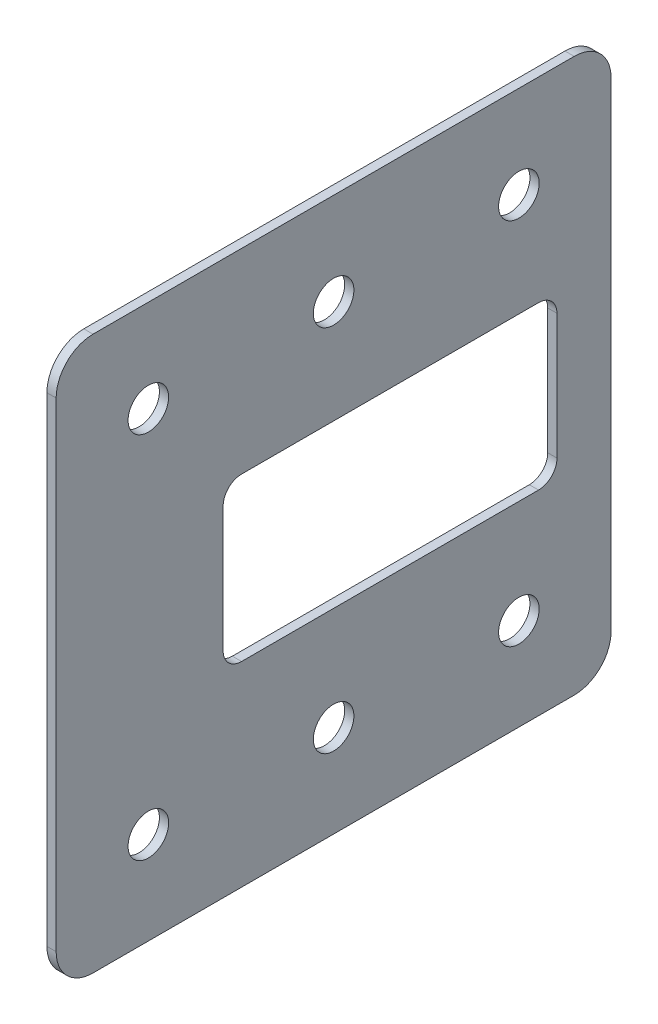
ISO-10303-21;
HEADER;
FILE_DESCRIPTION(('STEP AP214'),'2;1');
FILE_NAME('part.step','',(''),(''),'','','');
FILE_SCHEMA(('AUTOMOTIVE_DESIGN { 1 0 10303 214 1 1 1 1 }'));
ENDSEC;
DATA;
#1=APPLICATION_CONTEXT('core data for automotive mechanical design processes');
#2=APPLICATION_PROTOCOL_DEFINITION('international standard','automotive_design',2000,#1);
#3=PRODUCT_CONTEXT('',#1,'mechanical');
#4=PRODUCT('Part','Part','',(#3));
#5=PRODUCT_RELATED_PRODUCT_CATEGORY('part','',(#4));
#6=PRODUCT_DEFINITION_FORMATION('','',#4);
#7=PRODUCT_DEFINITION_CONTEXT('part definition',#1,'design');
#8=PRODUCT_DEFINITION('design','',#6,#7);
#9=PRODUCT_DEFINITION_SHAPE('','',#8);
#10=(LENGTH_UNIT() NAMED_UNIT(*) SI_UNIT(.MILLI.,.METRE.));
#11=(NAMED_UNIT(*) PLANE_ANGLE_UNIT() SI_UNIT($,.RADIAN.));
#12=(NAMED_UNIT(*) SI_UNIT($,.STERADIAN.) SOLID_ANGLE_UNIT());
#13=UNCERTAINTY_MEASURE_WITH_UNIT(LENGTH_MEASURE(1.E-05),#10,'distance_accuracy_value','');
#14=(GEOMETRIC_REPRESENTATION_CONTEXT(3) GLOBAL_UNCERTAINTY_ASSIGNED_CONTEXT((#13)) GLOBAL_UNIT_ASSIGNED_CONTEXT((#10,
#11,#12)) REPRESENTATION_CONTEXT('',''));
#15=CARTESIAN_POINT('',(0.,0.,0.));
#16=DIRECTION('',(0.,0.,1.));
#17=DIRECTION('',(1.,0.,0.));
#18=AXIS2_PLACEMENT_3D('',#15,#16,#17);
#19=CARTESIAN_POINT('',(8.89420183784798,150.,-191.416951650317));
#20=DIRECTION('',(0.,-1.,0.));
#21=DIRECTION('',(0.,0.,-1.));
#22=AXIS2_PLACEMENT_3D('',#19,#20,#21);
#23=PLANE('',#22);
#24=DIRECTION('',(0.,0.,-1.));
#25=VECTOR('',#24,1.);
#26=CARTESIAN_POINT('',(8.89420183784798,150.,-191.416951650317));
#27=LINE('',#26,#25);
#28=CARTESIAN_POINT('',(8.89420183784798,150.,-211.416951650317));
#29=VERTEX_POINT('',#28);
#30=CARTESIAN_POINT('',(8.89420183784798,150.,-472.33578257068));
#31=VERTEX_POINT('',#30);
#32=EDGE_CURVE('E170',#29,#31,#27,.T.);
#33=ORIENTED_EDGE('',*,*,#32,.F.);
#34=DIRECTION('',(-1.,0.,0.));
#35=VECTOR('',#34,1.);
#36=CARTESIAN_POINT('',(13.894201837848,150.,-211.416951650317));
#37=LINE('',#36,#35);
#38=CARTESIAN_POINT('',(13.894201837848,150.,-211.416951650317));
#39=VERTEX_POINT('',#38);
#40=EDGE_CURVE('E152',#29,#39,#37,.F.);
#41=ORIENTED_EDGE('',*,*,#40,.T.);
#42=DIRECTION('',(0.,0.,-1.));
#43=VECTOR('',#42,1.);
#44=CARTESIAN_POINT('',(13.894201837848,150.,-191.416951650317));
#45=LINE('',#44,#43);
#46=CARTESIAN_POINT('',(13.894201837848,150.,-472.33578257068));
#47=VERTEX_POINT('',#46);
#48=EDGE_CURVE('E177',#39,#47,#45,.T.);
#49=ORIENTED_EDGE('',*,*,#48,.T.);
#50=DIRECTION('',(-1.,0.,0.));
#51=VECTOR('',#50,1.);
#52=CARTESIAN_POINT('',(8.894201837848,150.,-472.33578257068));
#53=LINE('',#52,#51);
#54=EDGE_CURVE('E215',#47,#31,#53,.T.);
#55=ORIENTED_EDGE('',*,*,#54,.T.);
#56=EDGE_LOOP('',(#33,#41,#49,#55));
#57=FACE_BOUND('',#56,.T.);
#58=ADVANCED_FACE('F34',(#57),#23,.F.);
#59=CARTESIAN_POINT('',(8.89420183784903,-150.,-191.416951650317));
#60=DIRECTION('',(1.,0.,0.));
#61=DIRECTION('',(0.,1.,0.));
#62=AXIS2_PLACEMENT_3D('',#59,#60,#61);
#63=PLANE('',#62);
#64=DIRECTION('',(0.,0.,1.));
#65=VECTOR('',#64,1.);
#66=CARTESIAN_POINT('',(8.89420183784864,-43.9999999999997,-462.992636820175));
#67=LINE('',#66,#65);
#68=CARTESIAN_POINT('',(8.89420183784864,-43.9999999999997,-452.992636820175));
#69=VERTEX_POINT('',#68);
#70=CARTESIAN_POINT('',(8.89420183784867,-43.9999999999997,-291.973300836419));
#71=VERTEX_POINT('',#70);
#72=EDGE_CURVE('E285',#69,#71,#67,.T.);
#73=ORIENTED_EDGE('',*,*,#72,.F.);
#74=CARTESIAN_POINT('',(8.89420183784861,-33.9999999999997,-452.992636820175));
#75=DIRECTION('',(1.,0.,0.));
#76=DIRECTION('',(0.,1.,0.));
#77=AXIS2_PLACEMENT_3D('',#74,#75,#76);
#78=CIRCLE('',#77,10.);
#79=CARTESIAN_POINT('',(8.89420183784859,-33.9999999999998,-462.992636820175));
#80=VERTEX_POINT('',#79);
#81=EDGE_CURVE('E250',#69,#80,#78,.T.);
#82=ORIENTED_EDGE('',*,*,#81,.T.);
#83=DIRECTION('',(0.,-1.,0.));
#84=VECTOR('',#83,1.);
#85=CARTESIAN_POINT('',(8.89420183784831,43.9999999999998,-462.992636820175));
#86=LINE('',#85,#84);
#87=CARTESIAN_POINT('',(8.89420183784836,33.9999999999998,-462.992636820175));
#88=VERTEX_POINT('',#87);
#89=EDGE_CURVE('E260',#88,#80,#86,.T.);
#90=ORIENTED_EDGE('',*,*,#89,.F.);
#91=CARTESIAN_POINT('',(8.89420183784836,33.9999999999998,-452.992636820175));
#92=DIRECTION('',(1.,0.,0.));
#93=DIRECTION('',(0.,1.,0.));
#94=AXIS2_PLACEMENT_3D('',#91,#92,#93);
#95=CIRCLE('',#94,10.);
#96=CARTESIAN_POINT('',(8.89420183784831,43.9999999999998,-452.992636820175));
#97=VERTEX_POINT('',#96);
#98=EDGE_CURVE('E42',#88,#97,#95,.T.);
#99=ORIENTED_EDGE('',*,*,#98,.T.);
#100=DIRECTION('',(0.,0.,-1.));
#101=VECTOR('',#100,1.);
#102=CARTESIAN_POINT('',(8.89420183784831,43.9999999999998,-462.992636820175));
#103=LINE('',#102,#101);
#104=CARTESIAN_POINT('',(8.89420183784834,43.9999999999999,-291.973300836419));
#105=VERTEX_POINT('',#104);
#106=EDGE_CURVE('E259',#105,#97,#103,.T.);
#107=ORIENTED_EDGE('',*,*,#106,.F.);
#108=CARTESIAN_POINT('',(8.89420183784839,33.9999999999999,-291.973300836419));
#109=DIRECTION('',(1.,0.,0.));
#110=DIRECTION('',(0.,1.,0.));
#111=AXIS2_PLACEMENT_3D('',#108,#109,#110);
#112=CIRCLE('',#111,10.);
#113=CARTESIAN_POINT('',(8.89420183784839,33.9999999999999,-281.973300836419));
#114=VERTEX_POINT('',#113);
#115=EDGE_CURVE('E242',#105,#114,#112,.T.);
#116=ORIENTED_EDGE('',*,*,#115,.T.);
#117=DIRECTION('',(0.,1.,0.));
#118=VECTOR('',#117,1.);
#119=CARTESIAN_POINT('',(8.89420183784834,43.9999999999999,-281.973300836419));
#120=LINE('',#119,#118);
#121=CARTESIAN_POINT('',(8.89420183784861,-33.9999999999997,-281.973300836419));
#122=VERTEX_POINT('',#121);
#123=EDGE_CURVE('E269',#122,#114,#120,.T.);
#124=ORIENTED_EDGE('',*,*,#123,.F.);
#125=CARTESIAN_POINT('',(8.89420183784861,-33.9999999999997,-291.973300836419));
#126=DIRECTION('',(1.,0.,0.));
#127=DIRECTION('',(0.,1.,0.));
#128=AXIS2_PLACEMENT_3D('',#125,#126,#127);
#129=CIRCLE('',#128,10.);
#130=EDGE_CURVE('E246',#122,#71,#129,.T.);
#131=ORIENTED_EDGE('',*,*,#130,.T.);
#132=EDGE_LOOP('',(#73,#82,#90,#99,#107,#116,#124,#131));
#133=FACE_BOUND('',#132,.T.);
#134=CARTESIAN_POINT('',(8.89420183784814,99.9999999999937,-241.416951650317));
#135=DIRECTION('',(1.,0.,0.));
#136=DIRECTION('',(0.,1.,0.));
#137=AXIS2_PLACEMENT_3D('',#134,#135,#136);
#138=CIRCLE('',#137,10.9999999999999);
#139=CARTESIAN_POINT('',(8.8942018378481,110.999999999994,-241.416951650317));
#140=VERTEX_POINT('',#139);
#141=EDGE_CURVE('E183',#140,#140,#138,.T.);
#142=ORIENTED_EDGE('',*,*,#141,.T.);
#143=EDGE_LOOP('',(#142));
#144=FACE_BOUND('',#143,.T.);
#145=CARTESIAN_POINT('',(8.89420183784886,-100.000000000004,-341.876367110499));
#146=DIRECTION('',(1.,0.,0.));
#147=DIRECTION('',(0.,1.,0.));
#148=AXIS2_PLACEMENT_3D('',#145,#146,#147);
#149=CIRCLE('',#148,11.);
#150=CARTESIAN_POINT('',(8.89420183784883,-89.0000000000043,-341.876367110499));
#151=VERTEX_POINT('',#150);
#152=EDGE_CURVE('E318',#151,#151,#149,.T.);
#153=ORIENTED_EDGE('',*,*,#152,.T.);
#154=EDGE_LOOP('',(#153));
#155=FACE_BOUND('',#154,.T.);
#156=CARTESIAN_POINT('',(8.89420183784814,99.9999999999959,-341.876367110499));
#157=DIRECTION('',(1.,0.,0.));
#158=DIRECTION('',(0.,1.,0.));
#159=AXIS2_PLACEMENT_3D('',#156,#157,#158);
#160=CIRCLE('',#159,11.);
#161=CARTESIAN_POINT('',(8.8942018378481,110.999999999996,-341.876367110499));
#162=VERTEX_POINT('',#161);
#163=EDGE_CURVE('E316',#162,#162,#160,.T.);
#164=ORIENTED_EDGE('',*,*,#163,.T.);
#165=EDGE_LOOP('',(#164));
#166=FACE_BOUND('',#165,.T.);
#167=CARTESIAN_POINT('',(8.89420183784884,-100.000000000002,-442.335782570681));
#168=DIRECTION('',(1.,0.,0.));
#169=DIRECTION('',(0.,1.,0.));
#170=AXIS2_PLACEMENT_3D('',#167,#168,#169);
#171=CIRCLE('',#170,11.0000000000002);
#172=CARTESIAN_POINT('',(8.8942018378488,-89.0000000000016,-442.335782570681));
#173=VERTEX_POINT('',#172);
#174=EDGE_CURVE('E313',#173,#173,#171,.T.);
#175=ORIENTED_EDGE('',*,*,#174,.T.);
#176=EDGE_LOOP('',(#175));
#177=FACE_BOUND('',#176,.T.);
#178=CARTESIAN_POINT('',(8.89420183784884,-100.000000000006,-241.416951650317));
#179=DIRECTION('',(1.,0.,0.));
#180=DIRECTION('',(0.,1.,0.));
#181=AXIS2_PLACEMENT_3D('',#178,#179,#180);
#182=CIRCLE('',#181,10.9999999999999);
#183=CARTESIAN_POINT('',(8.8942018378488,-89.0000000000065,-241.416951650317));
#184=VERTEX_POINT('',#183);
#185=EDGE_CURVE('E310',#184,#184,#182,.T.);
#186=ORIENTED_EDGE('',*,*,#185,.T.);
#187=EDGE_LOOP('',(#186));
#188=FACE_BOUND('',#187,.T.);
#189=CARTESIAN_POINT('',(8.89420183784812,99.9999999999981,-442.335782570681));
#190=DIRECTION('',(1.,0.,0.));
#191=DIRECTION('',(0.,1.,0.));
#192=AXIS2_PLACEMENT_3D('',#189,#190,#191);
#193=CIRCLE('',#192,11.0000000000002);
#194=CARTESIAN_POINT('',(8.89420183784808,110.999999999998,-442.335782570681));
#195=VERTEX_POINT('',#194);
#196=EDGE_CURVE('E307',#195,#195,#193,.T.);
#197=ORIENTED_EDGE('',*,*,#196,.T.);
#198=EDGE_LOOP('',(#197));
#199=FACE_BOUND('',#198,.T.);
#200=DIRECTION('',(0.,0.,-1.));
#201=VECTOR('',#200,1.);
#202=CARTESIAN_POINT('',(8.89420183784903,-150.,-191.416951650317));
#203=LINE('',#202,#201);
#204=CARTESIAN_POINT('',(8.89420183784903,-150.,-211.416951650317));
#205=VERTEX_POINT('',#204);
#206=CARTESIAN_POINT('',(8.89420183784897,-150.,-472.33578257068));
#207=VERTEX_POINT('',#206);
#208=EDGE_CURVE('E193',#205,#207,#203,.T.);
#209=ORIENTED_EDGE('',*,*,#208,.F.);
#210=CARTESIAN_POINT('',(8.89420183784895,-130.,-211.416951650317));
#211=DIRECTION('',(1.,0.,0.));
#212=DIRECTION('',(0.,1.,0.));
#213=AXIS2_PLACEMENT_3D('',#210,#211,#212);
#214=CIRCLE('',#213,20.);
#215=CARTESIAN_POINT('',(8.89420183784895,-130.,-191.416951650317));
#216=VERTEX_POINT('',#215);
#217=EDGE_CURVE('E157',#205,#216,#214,.F.);
#218=ORIENTED_EDGE('',*,*,#217,.T.);
#219=DIRECTION('',(0.,-1.,0.));
#220=VECTOR('',#219,1.);
#221=CARTESIAN_POINT('',(8.89420183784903,-150.,-191.416951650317));
#222=LINE('',#221,#220);
#223=CARTESIAN_POINT('',(8.89420183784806,130.,-191.416951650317));
#224=VERTEX_POINT('',#223);
#225=EDGE_CURVE('E165',#224,#216,#222,.T.);
#226=ORIENTED_EDGE('',*,*,#225,.F.);
#227=CARTESIAN_POINT('',(8.89420183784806,130.,-211.416951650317));
#228=DIRECTION('',(1.,0.,0.));
#229=DIRECTION('',(0.,1.,0.));
#230=AXIS2_PLACEMENT_3D('',#227,#228,#229);
#231=CIRCLE('',#230,20.);
#232=EDGE_CURVE('E147',#224,#29,#231,.F.);
#233=ORIENTED_EDGE('',*,*,#232,.T.);
#234=ORIENTED_EDGE('',*,*,#32,.T.);
#235=CARTESIAN_POINT('',(8.89420183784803,130.,-472.33578257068));
#236=DIRECTION('',(1.,0.,0.));
#237=DIRECTION('',(0.,1.,0.));
#238=AXIS2_PLACEMENT_3D('',#235,#236,#237);
#239=CIRCLE('',#238,20.);
#240=CARTESIAN_POINT('',(8.89420183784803,130.,-492.335782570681));
#241=VERTEX_POINT('',#240);
#242=EDGE_CURVE('E211',#31,#241,#239,.F.);
#243=ORIENTED_EDGE('',*,*,#242,.T.);
#244=DIRECTION('',(0.,-1.,0.));
#245=VECTOR('',#244,1.);
#246=CARTESIAN_POINT('',(8.89420183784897,-150.,-492.335782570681));
#247=LINE('',#246,#245);
#248=CARTESIAN_POINT('',(8.89420183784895,-130.,-492.335782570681));
#249=VERTEX_POINT('',#248);
#250=EDGE_CURVE('E180',#241,#249,#247,.T.);
#251=ORIENTED_EDGE('',*,*,#250,.T.);
#252=CARTESIAN_POINT('',(8.89420183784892,-130.,-472.33578257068));
#253=DIRECTION('',(1.,0.,0.));
#254=DIRECTION('',(0.,1.,0.));
#255=AXIS2_PLACEMENT_3D('',#252,#253,#254);
#256=CIRCLE('',#255,20.);
#257=EDGE_CURVE('E158',#249,#207,#256,.F.);
#258=ORIENTED_EDGE('',*,*,#257,.T.);
#259=EDGE_LOOP('',(#209,#218,#226,#233,#234,#243,#251,#258));
#260=FACE_BOUND('',#259,.T.);
#261=ADVANCED_FACE('F173',(#133,#144,#155,#166,#177,#188,#199,#260),#63,.F.);
#262=CARTESIAN_POINT('',(8.89420183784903,-150.,-191.416951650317));
#263=DIRECTION('',(0.,1.,0.));
#264=DIRECTION('',(0.,0.,1.));
#265=AXIS2_PLACEMENT_3D('',#262,#263,#264);
#266=PLANE('',#265);
#267=DIRECTION('',(0.,0.,-1.));
#268=VECTOR('',#267,1.);
#269=CARTESIAN_POINT('',(13.894201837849,-150.,-191.416951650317));
#270=LINE('',#269,#268);
#271=CARTESIAN_POINT('',(13.894201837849,-150.,-211.416951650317));
#272=VERTEX_POINT('',#271);
#273=CARTESIAN_POINT('',(13.894201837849,-150.,-472.33578257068));
#274=VERTEX_POINT('',#273);
#275=EDGE_CURVE('E190',#272,#274,#270,.T.);
#276=ORIENTED_EDGE('',*,*,#275,.F.);
#277=DIRECTION('',(1.,0.,0.));
#278=VECTOR('',#277,1.);
#279=CARTESIAN_POINT('',(8.89420183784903,-150.,-211.416951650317));
#280=LINE('',#279,#278);
#281=EDGE_CURVE('E209',#272,#205,#280,.F.);
#282=ORIENTED_EDGE('',*,*,#281,.T.);
#283=ORIENTED_EDGE('',*,*,#208,.T.);
#284=DIRECTION('',(1.,0.,0.));
#285=VECTOR('',#284,1.);
#286=CARTESIAN_POINT('',(8.89420183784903,-150.,-472.33578257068));
#287=LINE('',#286,#285);
#288=EDGE_CURVE('E206',#207,#274,#287,.T.);
#289=ORIENTED_EDGE('',*,*,#288,.T.);
#290=EDGE_LOOP('',(#276,#282,#283,#289));
#291=FACE_BOUND('',#290,.T.);
#292=ADVANCED_FACE('F345',(#291),#266,.F.);
#293=CARTESIAN_POINT('',(13.894201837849,-150.,-191.416951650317));
#294=DIRECTION('',(-1.,0.,0.));
#295=DIRECTION('',(0.,-1.,0.));
#296=AXIS2_PLACEMENT_3D('',#293,#294,#295);
#297=PLANE('',#296);
#298=DIRECTION('',(0.,1.,0.));
#299=VECTOR('',#298,1.);
#300=CARTESIAN_POINT('',(13.8942018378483,43.9999999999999,-281.973300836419));
#301=LINE('',#300,#299);
#302=CARTESIAN_POINT('',(13.8942018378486,-33.9999999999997,-281.973300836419));
#303=VERTEX_POINT('',#302);
#304=CARTESIAN_POINT('',(13.8942018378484,33.9999999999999,-281.973300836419));
#305=VERTEX_POINT('',#304);
#306=EDGE_CURVE('E276',#303,#305,#301,.T.);
#307=ORIENTED_EDGE('',*,*,#306,.T.);
#308=CARTESIAN_POINT('',(13.8942018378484,33.9999999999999,-291.973300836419));
#309=DIRECTION('',(-1.,0.,0.));
#310=DIRECTION('',(0.,-1.,0.));
#311=AXIS2_PLACEMENT_3D('',#308,#309,#310);
#312=CIRCLE('',#311,10.);
#313=CARTESIAN_POINT('',(13.8942018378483,43.9999999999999,-291.973300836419));
#314=VERTEX_POINT('',#313);
#315=EDGE_CURVE('E244',#305,#314,#312,.T.);
#316=ORIENTED_EDGE('',*,*,#315,.T.);
#317=DIRECTION('',(0.,0.,-1.));
#318=VECTOR('',#317,1.);
#319=CARTESIAN_POINT('',(13.8942018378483,43.9999999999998,-462.992636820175));
#320=LINE('',#319,#318);
#321=CARTESIAN_POINT('',(13.8942018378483,43.9999999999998,-452.992636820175));
#322=VERTEX_POINT('',#321);
#323=EDGE_CURVE('E281',#314,#322,#320,.T.);
#324=ORIENTED_EDGE('',*,*,#323,.T.);
#325=CARTESIAN_POINT('',(13.8942018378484,33.9999999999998,-452.992636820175));
#326=DIRECTION('',(-1.,0.,0.));
#327=DIRECTION('',(0.,-1.,0.));
#328=AXIS2_PLACEMENT_3D('',#325,#326,#327);
#329=CIRCLE('',#328,10.);
#330=CARTESIAN_POINT('',(13.8942018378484,33.9999999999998,-462.992636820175));
#331=VERTEX_POINT('',#330);
#332=EDGE_CURVE('E11',#322,#331,#329,.T.);
#333=ORIENTED_EDGE('',*,*,#332,.T.);
#334=DIRECTION('',(0.,-1.,0.));
#335=VECTOR('',#334,1.);
#336=CARTESIAN_POINT('',(13.8942018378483,43.9999999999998,-462.992636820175));
#337=LINE('',#336,#335);
#338=CARTESIAN_POINT('',(13.8942018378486,-33.9999999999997,-462.992636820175));
#339=VERTEX_POINT('',#338);
#340=EDGE_CURVE('E268',#331,#339,#337,.T.);
#341=ORIENTED_EDGE('',*,*,#340,.T.);
#342=CARTESIAN_POINT('',(13.8942018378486,-33.9999999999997,-452.992636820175));
#343=DIRECTION('',(-1.,0.,0.));
#344=DIRECTION('',(0.,-1.,0.));
#345=AXIS2_PLACEMENT_3D('',#342,#343,#344);
#346=CIRCLE('',#345,10.);
#347=CARTESIAN_POINT('',(13.8942018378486,-43.9999999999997,-452.992636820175));
#348=VERTEX_POINT('',#347);
#349=EDGE_CURVE('E252',#339,#348,#346,.T.);
#350=ORIENTED_EDGE('',*,*,#349,.T.);
#351=DIRECTION('',(0.,0.,1.));
#352=VECTOR('',#351,1.);
#353=CARTESIAN_POINT('',(13.8942018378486,-43.9999999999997,-462.992636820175));
#354=LINE('',#353,#352);
#355=CARTESIAN_POINT('',(13.8942018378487,-43.9999999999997,-291.973300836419));
#356=VERTEX_POINT('',#355);
#357=EDGE_CURVE('E273',#348,#356,#354,.T.);
#358=ORIENTED_EDGE('',*,*,#357,.T.);
#359=CARTESIAN_POINT('',(13.8942018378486,-33.9999999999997,-291.973300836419));
#360=DIRECTION('',(-1.,0.,0.));
#361=DIRECTION('',(0.,-1.,0.));
#362=AXIS2_PLACEMENT_3D('',#359,#360,#361);
#363=CIRCLE('',#362,10.);
#364=EDGE_CURVE('E248',#356,#303,#363,.T.);
#365=ORIENTED_EDGE('',*,*,#364,.T.);
#366=EDGE_LOOP('',(#307,#316,#324,#333,#341,#350,#358,#365));
#367=FACE_BOUND('',#366,.T.);
#368=CARTESIAN_POINT('',(13.8942018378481,99.9999999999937,-241.416951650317));
#369=DIRECTION('',(1.,0.,0.));
#370=DIRECTION('',(0.,1.,0.));
#371=AXIS2_PLACEMENT_3D('',#368,#369,#370);
#372=CIRCLE('',#371,10.9999999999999);
#373=CARTESIAN_POINT('',(13.8942018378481,110.999999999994,-241.416951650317));
#374=VERTEX_POINT('',#373);
#375=EDGE_CURVE('E292',#374,#374,#372,.T.);
#376=ORIENTED_EDGE('',*,*,#375,.F.);
#377=EDGE_LOOP('',(#376));
#378=FACE_BOUND('',#377,.T.);
#379=CARTESIAN_POINT('',(13.8942018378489,-100.000000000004,-341.876367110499));
#380=DIRECTION('',(1.,0.,0.));
#381=DIRECTION('',(0.,1.,0.));
#382=AXIS2_PLACEMENT_3D('',#379,#380,#381);
#383=CIRCLE('',#382,11.);
#384=CARTESIAN_POINT('',(13.8942018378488,-89.0000000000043,-341.876367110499));
#385=VERTEX_POINT('',#384);
#386=EDGE_CURVE('E293',#385,#385,#383,.T.);
#387=ORIENTED_EDGE('',*,*,#386,.F.);
#388=EDGE_LOOP('',(#387));
#389=FACE_BOUND('',#388,.T.);
#390=CARTESIAN_POINT('',(13.8942018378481,99.9999999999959,-341.876367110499));
#391=DIRECTION('',(1.,0.,0.));
#392=DIRECTION('',(0.,1.,0.));
#393=AXIS2_PLACEMENT_3D('',#390,#391,#392);
#394=CIRCLE('',#393,11.);
#395=CARTESIAN_POINT('',(13.8942018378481,110.999999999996,-341.876367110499));
#396=VERTEX_POINT('',#395);
#397=EDGE_CURVE('E296',#396,#396,#394,.T.);
#398=ORIENTED_EDGE('',*,*,#397,.F.);
#399=EDGE_LOOP('',(#398));
#400=FACE_BOUND('',#399,.T.);
#401=CARTESIAN_POINT('',(13.8942018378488,-100.000000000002,-442.335782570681));
#402=DIRECTION('',(1.,0.,0.));
#403=DIRECTION('',(0.,1.,0.));
#404=AXIS2_PLACEMENT_3D('',#401,#402,#403);
#405=CIRCLE('',#404,11.0000000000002);
#406=CARTESIAN_POINT('',(13.8942018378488,-89.0000000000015,-442.335782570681));
#407=VERTEX_POINT('',#406);
#408=EDGE_CURVE('E299',#407,#407,#405,.T.);
#409=ORIENTED_EDGE('',*,*,#408,.F.);
#410=EDGE_LOOP('',(#409));
#411=FACE_BOUND('',#410,.T.);
#412=CARTESIAN_POINT('',(13.8942018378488,-100.000000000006,-241.416951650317));
#413=DIRECTION('',(1.,0.,0.));
#414=DIRECTION('',(0.,1.,0.));
#415=AXIS2_PLACEMENT_3D('',#412,#413,#414);
#416=CIRCLE('',#415,10.9999999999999);
#417=CARTESIAN_POINT('',(13.8942018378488,-89.0000000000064,-241.416951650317));
#418=VERTEX_POINT('',#417);
#419=EDGE_CURVE('E283',#418,#418,#416,.T.);
#420=ORIENTED_EDGE('',*,*,#419,.F.);
#421=EDGE_LOOP('',(#420));
#422=FACE_BOUND('',#421,.T.);
#423=CARTESIAN_POINT('',(13.8942018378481,99.9999999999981,-442.335782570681));
#424=DIRECTION('',(1.,0.,0.));
#425=DIRECTION('',(0.,1.,0.));
#426=AXIS2_PLACEMENT_3D('',#423,#424,#425);
#427=CIRCLE('',#426,11.0000000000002);
#428=CARTESIAN_POINT('',(13.8942018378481,110.999999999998,-442.335782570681));
#429=VERTEX_POINT('',#428);
#430=EDGE_CURVE('E302',#429,#429,#427,.T.);
#431=ORIENTED_EDGE('',*,*,#430,.F.);
#432=EDGE_LOOP('',(#431));
#433=FACE_BOUND('',#432,.T.);
#434=DIRECTION('',(0.,1.,0.));
#435=VECTOR('',#434,1.);
#436=CARTESIAN_POINT('',(13.894201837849,-150.,-191.416951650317));
#437=LINE('',#436,#435);
#438=CARTESIAN_POINT('',(13.894201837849,-130.,-191.416951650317));
#439=VERTEX_POINT('',#438);
#440=CARTESIAN_POINT('',(13.8942018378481,130.,-191.416951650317));
#441=VERTEX_POINT('',#440);
#442=EDGE_CURVE('E168',#439,#441,#437,.T.);
#443=ORIENTED_EDGE('',*,*,#442,.F.);
#444=CARTESIAN_POINT('',(13.894201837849,-130.,-211.416951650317));
#445=DIRECTION('',(-1.,0.,0.));
#446=DIRECTION('',(0.,-1.,0.));
#447=AXIS2_PLACEMENT_3D('',#444,#445,#446);
#448=CIRCLE('',#447,20.);
#449=EDGE_CURVE('E204',#439,#272,#448,.F.);
#450=ORIENTED_EDGE('',*,*,#449,.T.);
#451=ORIENTED_EDGE('',*,*,#275,.T.);
#452=CARTESIAN_POINT('',(13.8942018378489,-130.,-472.33578257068));
#453=DIRECTION('',(-1.,0.,0.));
#454=DIRECTION('',(0.,-1.,0.));
#455=AXIS2_PLACEMENT_3D('',#452,#453,#454);
#456=CIRCLE('',#455,20.);
#457=CARTESIAN_POINT('',(13.8942018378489,-130.,-492.335782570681));
#458=VERTEX_POINT('',#457);
#459=EDGE_CURVE('E200',#274,#458,#456,.F.);
#460=ORIENTED_EDGE('',*,*,#459,.T.);
#461=DIRECTION('',(0.,1.,0.));
#462=VECTOR('',#461,1.);
#463=CARTESIAN_POINT('',(13.894201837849,-150.,-492.335782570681));
#464=LINE('',#463,#462);
#465=CARTESIAN_POINT('',(13.894201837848,130.,-492.335782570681));
#466=VERTEX_POINT('',#465);
#467=EDGE_CURVE('E175',#458,#466,#464,.T.);
#468=ORIENTED_EDGE('',*,*,#467,.T.);
#469=CARTESIAN_POINT('',(13.894201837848,130.,-472.33578257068));
#470=DIRECTION('',(-1.,0.,0.));
#471=DIRECTION('',(0.,-1.,0.));
#472=AXIS2_PLACEMENT_3D('',#469,#470,#471);
#473=CIRCLE('',#472,20.);
#474=EDGE_CURVE('E198',#466,#47,#473,.F.);
#475=ORIENTED_EDGE('',*,*,#474,.T.);
#476=ORIENTED_EDGE('',*,*,#48,.F.);
#477=CARTESIAN_POINT('',(13.8942018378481,130.,-211.416951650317));
#478=DIRECTION('',(-1.,0.,0.));
#479=DIRECTION('',(0.,-1.,0.));
#480=AXIS2_PLACEMENT_3D('',#477,#478,#479);
#481=CIRCLE('',#480,20.);
#482=EDGE_CURVE('E202',#39,#441,#481,.F.);
#483=ORIENTED_EDGE('',*,*,#482,.T.);
#484=EDGE_LOOP('',(#443,#450,#451,#460,#468,#475,#476,#483));
#485=FACE_BOUND('',#484,.T.);
#486=ADVANCED_FACE('F381',(#367,#378,#389,#400,#411,#422,#433,#485),#297,.F.);
#487=CARTESIAN_POINT('',(0.,0.,-191.416951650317));
#488=DIRECTION('',(0.,0.,1.));
#489=DIRECTION('',(1.,0.,0.));
#490=AXIS2_PLACEMENT_3D('',#487,#488,#489);
#491=PLANE('',#490);
#492=ORIENTED_EDGE('',*,*,#225,.T.);
#493=DIRECTION('',(1.,0.,0.));
#494=VECTOR('',#493,1.);
#495=CARTESIAN_POINT('',(13.894201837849,-130.,-191.416951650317));
#496=LINE('',#495,#494);
#497=EDGE_CURVE('E169',#216,#439,#496,.T.);
#498=ORIENTED_EDGE('',*,*,#497,.T.);
#499=ORIENTED_EDGE('',*,*,#442,.T.);
#500=DIRECTION('',(-1.,0.,0.));
#501=VECTOR('',#500,1.);
#502=CARTESIAN_POINT('',(8.894201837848,130.,-191.416951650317));
#503=LINE('',#502,#501);
#504=EDGE_CURVE('E151',#441,#224,#503,.T.);
#505=ORIENTED_EDGE('',*,*,#504,.T.);
#506=EDGE_LOOP('',(#492,#498,#499,#505));
#507=FACE_BOUND('',#506,.T.);
#508=ADVANCED_FACE('F163',(#507),#491,.T.);
#509=CARTESIAN_POINT('',(0.,0.,-492.335782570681));
#510=DIRECTION('',(0.,0.,1.));
#511=DIRECTION('',(1.,0.,0.));
#512=AXIS2_PLACEMENT_3D('',#509,#510,#511);
#513=PLANE('',#512);
#514=ORIENTED_EDGE('',*,*,#467,.F.);
#515=DIRECTION('',(1.,0.,0.));
#516=VECTOR('',#515,1.);
#517=CARTESIAN_POINT('',(0.,-130.,-492.335782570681));
#518=LINE('',#517,#516);
#519=EDGE_CURVE('E221',#458,#249,#518,.F.);
#520=ORIENTED_EDGE('',*,*,#519,.T.);
#521=ORIENTED_EDGE('',*,*,#250,.F.);
#522=DIRECTION('',(-1.,0.,0.));
#523=VECTOR('',#522,1.);
#524=CARTESIAN_POINT('',(0.,130.,-492.335782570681));
#525=LINE('',#524,#523);
#526=EDGE_CURVE('E219',#241,#466,#525,.F.);
#527=ORIENTED_EDGE('',*,*,#526,.T.);
#528=EDGE_LOOP('',(#514,#520,#521,#527));
#529=FACE_BOUND('',#528,.T.);
#530=ADVANCED_FACE('F352',(#529),#513,.F.);
#531=CARTESIAN_POINT('',(0.,-130.,-211.416951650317));
#532=DIRECTION('',(-1.,0.,0.));
#533=DIRECTION('',(0.,0.,1.));
#534=AXIS2_PLACEMENT_3D('',#531,#532,#533);
#535=CYLINDRICAL_SURFACE('',#534,20.);
#536=ORIENTED_EDGE('',*,*,#217,.F.);
#537=ORIENTED_EDGE('',*,*,#281,.F.);
#538=ORIENTED_EDGE('',*,*,#449,.F.);
#539=ORIENTED_EDGE('',*,*,#497,.F.);
#540=EDGE_LOOP('',(#536,#537,#538,#539));
#541=FACE_BOUND('',#540,.T.);
#542=ADVANCED_FACE('F349',(#541),#535,.T.);
#543=CARTESIAN_POINT('',(0.,130.,-211.416951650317));
#544=DIRECTION('',(1.,0.,0.));
#545=DIRECTION('',(0.,0.,-1.));
#546=AXIS2_PLACEMENT_3D('',#543,#544,#545);
#547=CYLINDRICAL_SURFACE('',#546,20.);
#548=ORIENTED_EDGE('',*,*,#482,.F.);
#549=ORIENTED_EDGE('',*,*,#40,.F.);
#550=ORIENTED_EDGE('',*,*,#232,.F.);
#551=ORIENTED_EDGE('',*,*,#504,.F.);
#552=EDGE_LOOP('',(#548,#549,#550,#551));
#553=FACE_BOUND('',#552,.T.);
#554=ADVANCED_FACE('F150',(#553),#547,.T.);
#555=CARTESIAN_POINT('',(8.89420183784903,-130.,-472.33578257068));
#556=DIRECTION('',(1.,0.,0.));
#557=DIRECTION('',(0.,0.,-1.));
#558=AXIS2_PLACEMENT_3D('',#555,#556,#557);
#559=CYLINDRICAL_SURFACE('',#558,20.);
#560=ORIENTED_EDGE('',*,*,#257,.F.);
#561=ORIENTED_EDGE('',*,*,#519,.F.);
#562=ORIENTED_EDGE('',*,*,#459,.F.);
#563=ORIENTED_EDGE('',*,*,#288,.F.);
#564=EDGE_LOOP('',(#560,#561,#562,#563));
#565=FACE_BOUND('',#564,.T.);
#566=ADVANCED_FACE('F356',(#565),#559,.T.);
#567=CARTESIAN_POINT('',(8.89420183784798,130.,-472.33578257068));
#568=DIRECTION('',(-1.,0.,0.));
#569=DIRECTION('',(0.,0.,1.));
#570=AXIS2_PLACEMENT_3D('',#567,#568,#569);
#571=CYLINDRICAL_SURFACE('',#570,20.);
#572=ORIENTED_EDGE('',*,*,#474,.F.);
#573=ORIENTED_EDGE('',*,*,#526,.F.);
#574=ORIENTED_EDGE('',*,*,#242,.F.);
#575=ORIENTED_EDGE('',*,*,#54,.F.);
#576=EDGE_LOOP('',(#572,#573,#574,#575));
#577=FACE_BOUND('',#576,.T.);
#578=ADVANCED_FACE('F359',(#577),#571,.T.);
#579=CARTESIAN_POINT('',(3.89420183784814,99.9999999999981,-442.335782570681));
#580=DIRECTION('',(1.,0.,0.));
#581=DIRECTION('',(0.,1.,0.));
#582=AXIS2_PLACEMENT_3D('',#579,#580,#581);
#583=CYLINDRICAL_SURFACE('',#582,11.0000000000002);
#584=ORIENTED_EDGE('',*,*,#430,.T.);
#585=EDGE_LOOP('',(#584));
#586=FACE_BOUND('',#585,.T.);
#587=ORIENTED_EDGE('',*,*,#196,.F.);
#588=EDGE_LOOP('',(#587));
#589=FACE_BOUND('',#588,.T.);
#590=ADVANCED_FACE('F363',(#586,#589),#583,.F.);
#591=CARTESIAN_POINT('',(3.89420183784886,-100.000000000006,-241.416951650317));
#592=DIRECTION('',(1.,0.,0.));
#593=DIRECTION('',(0.,1.,0.));
#594=AXIS2_PLACEMENT_3D('',#591,#592,#593);
#595=CYLINDRICAL_SURFACE('',#594,10.9999999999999);
#596=ORIENTED_EDGE('',*,*,#419,.T.);
#597=EDGE_LOOP('',(#596));
#598=FACE_BOUND('',#597,.T.);
#599=ORIENTED_EDGE('',*,*,#185,.F.);
#600=EDGE_LOOP('',(#599));
#601=FACE_BOUND('',#600,.T.);
#602=ADVANCED_FACE('F402',(#598,#601),#595,.F.);
#603=CARTESIAN_POINT('',(3.89420183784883,-100.000000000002,-442.335782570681));
#604=DIRECTION('',(1.,0.,0.));
#605=DIRECTION('',(0.,1.,0.));
#606=AXIS2_PLACEMENT_3D('',#603,#604,#605);
#607=CYLINDRICAL_SURFACE('',#606,11.0000000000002);
#608=ORIENTED_EDGE('',*,*,#408,.T.);
#609=EDGE_LOOP('',(#608));
#610=FACE_BOUND('',#609,.T.);
#611=ORIENTED_EDGE('',*,*,#174,.F.);
#612=EDGE_LOOP('',(#611));
#613=FACE_BOUND('',#612,.T.);
#614=ADVANCED_FACE('F404',(#610,#613),#607,.F.);
#615=CARTESIAN_POINT('',(3.89420183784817,99.9999999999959,-341.876367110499));
#616=DIRECTION('',(1.,0.,0.));
#617=DIRECTION('',(0.,1.,0.));
#618=AXIS2_PLACEMENT_3D('',#615,#616,#617);
#619=CYLINDRICAL_SURFACE('',#618,11.);
#620=ORIENTED_EDGE('',*,*,#397,.T.);
#621=EDGE_LOOP('',(#620));
#622=FACE_BOUND('',#621,.T.);
#623=ORIENTED_EDGE('',*,*,#163,.F.);
#624=EDGE_LOOP('',(#623));
#625=FACE_BOUND('',#624,.T.);
#626=ADVANCED_FACE('F335',(#622,#625),#619,.F.);
#627=CARTESIAN_POINT('',(3.89420183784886,-100.000000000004,-341.876367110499));
#628=DIRECTION('',(1.,0.,0.));
#629=DIRECTION('',(0.,1.,0.));
#630=AXIS2_PLACEMENT_3D('',#627,#628,#629);
#631=CYLINDRICAL_SURFACE('',#630,11.);
#632=ORIENTED_EDGE('',*,*,#386,.T.);
#633=EDGE_LOOP('',(#632));
#634=FACE_BOUND('',#633,.T.);
#635=ORIENTED_EDGE('',*,*,#152,.F.);
#636=EDGE_LOOP('',(#635));
#637=FACE_BOUND('',#636,.T.);
#638=ADVANCED_FACE('F327',(#634,#637),#631,.F.);
#639=CARTESIAN_POINT('',(3.89420183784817,99.9999999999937,-241.416951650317));
#640=DIRECTION('',(1.,0.,0.));
#641=DIRECTION('',(0.,1.,0.));
#642=AXIS2_PLACEMENT_3D('',#639,#640,#641);
#643=CYLINDRICAL_SURFACE('',#642,10.9999999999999);
#644=ORIENTED_EDGE('',*,*,#375,.T.);
#645=EDGE_LOOP('',(#644));
#646=FACE_BOUND('',#645,.T.);
#647=ORIENTED_EDGE('',*,*,#141,.F.);
#648=EDGE_LOOP('',(#647));
#649=FACE_BOUND('',#648,.T.);
#650=ADVANCED_FACE('F325',(#646,#649),#643,.F.);
#651=CARTESIAN_POINT('',(13.8942018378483,43.9999999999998,-462.992636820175));
#652=DIRECTION('',(0.,0.,-1.));
#653=DIRECTION('',(-1.,0.,0.));
#654=AXIS2_PLACEMENT_3D('',#651,#652,#653);
#655=PLANE('',#654);
#656=ORIENTED_EDGE('',*,*,#89,.T.);
#657=DIRECTION('',(-1.,0.,0.));
#658=VECTOR('',#657,1.);
#659=CARTESIAN_POINT('',(13.8942018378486,-33.9999999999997,-462.992636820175));
#660=LINE('',#659,#658);
#661=EDGE_CURVE('E49',#80,#339,#660,.F.);
#662=ORIENTED_EDGE('',*,*,#661,.T.);
#663=ORIENTED_EDGE('',*,*,#340,.F.);
#664=DIRECTION('',(-1.,0.,0.));
#665=VECTOR('',#664,1.);
#666=CARTESIAN_POINT('',(8.89420183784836,33.9999999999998,-462.992636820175));
#667=LINE('',#666,#665);
#668=EDGE_CURVE('E238',#331,#88,#667,.T.);
#669=ORIENTED_EDGE('',*,*,#668,.T.);
#670=EDGE_LOOP('',(#656,#662,#663,#669));
#671=FACE_BOUND('',#670,.T.);
#672=ADVANCED_FACE('F271',(#671),#655,.F.);
#673=CARTESIAN_POINT('',(13.8942018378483,43.9999999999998,-462.992636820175));
#674=DIRECTION('',(0.,1.,0.));
#675=DIRECTION('',(-1.,0.,0.));
#676=AXIS2_PLACEMENT_3D('',#673,#674,#675);
#677=PLANE('',#676);
#678=ORIENTED_EDGE('',*,*,#323,.F.);
#679=DIRECTION('',(-1.,0.,0.));
#680=VECTOR('',#679,1.);
#681=CARTESIAN_POINT('',(8.89420183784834,43.9999999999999,-291.973300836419));
#682=LINE('',#681,#680);
#683=EDGE_CURVE('E225',#314,#105,#682,.T.);
#684=ORIENTED_EDGE('',*,*,#683,.T.);
#685=ORIENTED_EDGE('',*,*,#106,.T.);
#686=DIRECTION('',(-1.,0.,0.));
#687=VECTOR('',#686,1.);
#688=CARTESIAN_POINT('',(13.8942018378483,43.9999999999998,-452.992636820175));
#689=LINE('',#688,#687);
#690=EDGE_CURVE('E223',#97,#322,#689,.F.);
#691=ORIENTED_EDGE('',*,*,#690,.T.);
#692=EDGE_LOOP('',(#678,#684,#685,#691));
#693=FACE_BOUND('',#692,.T.);
#694=ADVANCED_FACE('F266',(#693),#677,.F.);
#695=CARTESIAN_POINT('',(13.8942018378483,43.9999999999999,-281.973300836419));
#696=DIRECTION('',(0.,0.,1.));
#697=DIRECTION('',(1.,0.,0.));
#698=AXIS2_PLACEMENT_3D('',#695,#696,#697);
#699=PLANE('',#698);
#700=ORIENTED_EDGE('',*,*,#123,.T.);
#701=DIRECTION('',(-1.,0.,0.));
#702=VECTOR('',#701,1.);
#703=CARTESIAN_POINT('',(13.8942018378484,33.9999999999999,-281.973300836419));
#704=LINE('',#703,#702);
#705=EDGE_CURVE('E231',#114,#305,#704,.F.);
#706=ORIENTED_EDGE('',*,*,#705,.T.);
#707=ORIENTED_EDGE('',*,*,#306,.F.);
#708=DIRECTION('',(-1.,0.,0.));
#709=VECTOR('',#708,1.);
#710=CARTESIAN_POINT('',(8.89420183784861,-33.9999999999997,-281.973300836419));
#711=LINE('',#710,#709);
#712=EDGE_CURVE('E228',#303,#122,#711,.T.);
#713=ORIENTED_EDGE('',*,*,#712,.T.);
#714=EDGE_LOOP('',(#700,#706,#707,#713));
#715=FACE_BOUND('',#714,.T.);
#716=ADVANCED_FACE('F390',(#715),#699,.F.);
#717=CARTESIAN_POINT('',(13.8942018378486,-43.9999999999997,-462.992636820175));
#718=DIRECTION('',(0.,-1.,0.));
#719=DIRECTION('',(1.,0.,0.));
#720=AXIS2_PLACEMENT_3D('',#717,#718,#719);
#721=PLANE('',#720);
#722=ORIENTED_EDGE('',*,*,#72,.T.);
#723=DIRECTION('',(-1.,0.,0.));
#724=VECTOR('',#723,1.);
#725=CARTESIAN_POINT('',(13.8942018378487,-43.9999999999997,-291.973300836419));
#726=LINE('',#725,#724);
#727=EDGE_CURVE('E236',#71,#356,#726,.F.);
#728=ORIENTED_EDGE('',*,*,#727,.T.);
#729=ORIENTED_EDGE('',*,*,#357,.F.);
#730=DIRECTION('',(-1.,0.,0.));
#731=VECTOR('',#730,1.);
#732=CARTESIAN_POINT('',(8.89420183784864,-43.9999999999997,-452.992636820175));
#733=LINE('',#732,#731);
#734=EDGE_CURVE('E233',#348,#69,#733,.T.);
#735=ORIENTED_EDGE('',*,*,#734,.T.);
#736=EDGE_LOOP('',(#722,#728,#729,#735));
#737=FACE_BOUND('',#736,.T.);
#738=ADVANCED_FACE('F369',(#737),#721,.F.);
#739=CARTESIAN_POINT('',(13.8942018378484,33.9999999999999,-291.973300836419));
#740=DIRECTION('',(1.,0.,0.));
#741=DIRECTION('',(0.,1.,0.));
#742=AXIS2_PLACEMENT_3D('',#739,#740,#741);
#743=CYLINDRICAL_SURFACE('',#742,10.);
#744=ORIENTED_EDGE('',*,*,#315,.F.);
#745=ORIENTED_EDGE('',*,*,#705,.F.);
#746=ORIENTED_EDGE('',*,*,#115,.F.);
#747=ORIENTED_EDGE('',*,*,#683,.F.);
#748=EDGE_LOOP('',(#744,#745,#746,#747));
#749=FACE_BOUND('',#748,.T.);
#750=ADVANCED_FACE('F365',(#749),#743,.F.);
#751=CARTESIAN_POINT('',(13.8942018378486,-33.9999999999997,-291.973300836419));
#752=DIRECTION('',(1.,0.,0.));
#753=DIRECTION('',(0.,1.,0.));
#754=AXIS2_PLACEMENT_3D('',#751,#752,#753);
#755=CYLINDRICAL_SURFACE('',#754,10.);
#756=ORIENTED_EDGE('',*,*,#364,.F.);
#757=ORIENTED_EDGE('',*,*,#727,.F.);
#758=ORIENTED_EDGE('',*,*,#130,.F.);
#759=ORIENTED_EDGE('',*,*,#712,.F.);
#760=EDGE_LOOP('',(#756,#757,#758,#759));
#761=FACE_BOUND('',#760,.T.);
#762=ADVANCED_FACE('F368',(#761),#755,.F.);
#763=CARTESIAN_POINT('',(13.8942018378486,-33.9999999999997,-452.992636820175));
#764=DIRECTION('',(1.,0.,0.));
#765=DIRECTION('',(0.,1.,0.));
#766=AXIS2_PLACEMENT_3D('',#763,#764,#765);
#767=CYLINDRICAL_SURFACE('',#766,10.);
#768=ORIENTED_EDGE('',*,*,#349,.F.);
#769=ORIENTED_EDGE('',*,*,#661,.F.);
#770=ORIENTED_EDGE('',*,*,#81,.F.);
#771=ORIENTED_EDGE('',*,*,#734,.F.);
#772=EDGE_LOOP('',(#768,#769,#770,#771));
#773=FACE_BOUND('',#772,.T.);
#774=ADVANCED_FACE('F372',(#773),#767,.F.);
#775=CARTESIAN_POINT('',(13.8942018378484,33.9999999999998,-452.992636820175));
#776=DIRECTION('',(1.,0.,0.));
#777=DIRECTION('',(0.,1.,0.));
#778=AXIS2_PLACEMENT_3D('',#775,#776,#777);
#779=CYLINDRICAL_SURFACE('',#778,10.);
#780=ORIENTED_EDGE('',*,*,#332,.F.);
#781=ORIENTED_EDGE('',*,*,#690,.F.);
#782=ORIENTED_EDGE('',*,*,#98,.F.);
#783=ORIENTED_EDGE('',*,*,#668,.F.);
#784=EDGE_LOOP('',(#780,#781,#782,#783));
#785=FACE_BOUND('',#784,.T.);
#786=ADVANCED_FACE('F36',(#785),#779,.F.);
#787=CLOSED_SHELL('',(#58,#261,#292,#486,#508,#530,#542,#554,#566,#578,#590,#602,#614,#626,#638,
#650,#672,#694,#716,#738,#750,#762,#774,#786));
#788=MANIFOLD_SOLID_BREP('B2',#787);
#789=ADVANCED_BREP_SHAPE_REPRESENTATION('',(#18,#788),#14);
#790=SHAPE_DEFINITION_REPRESENTATION(#9,#789);
ENDSEC;
END-ISO-10303-21;
